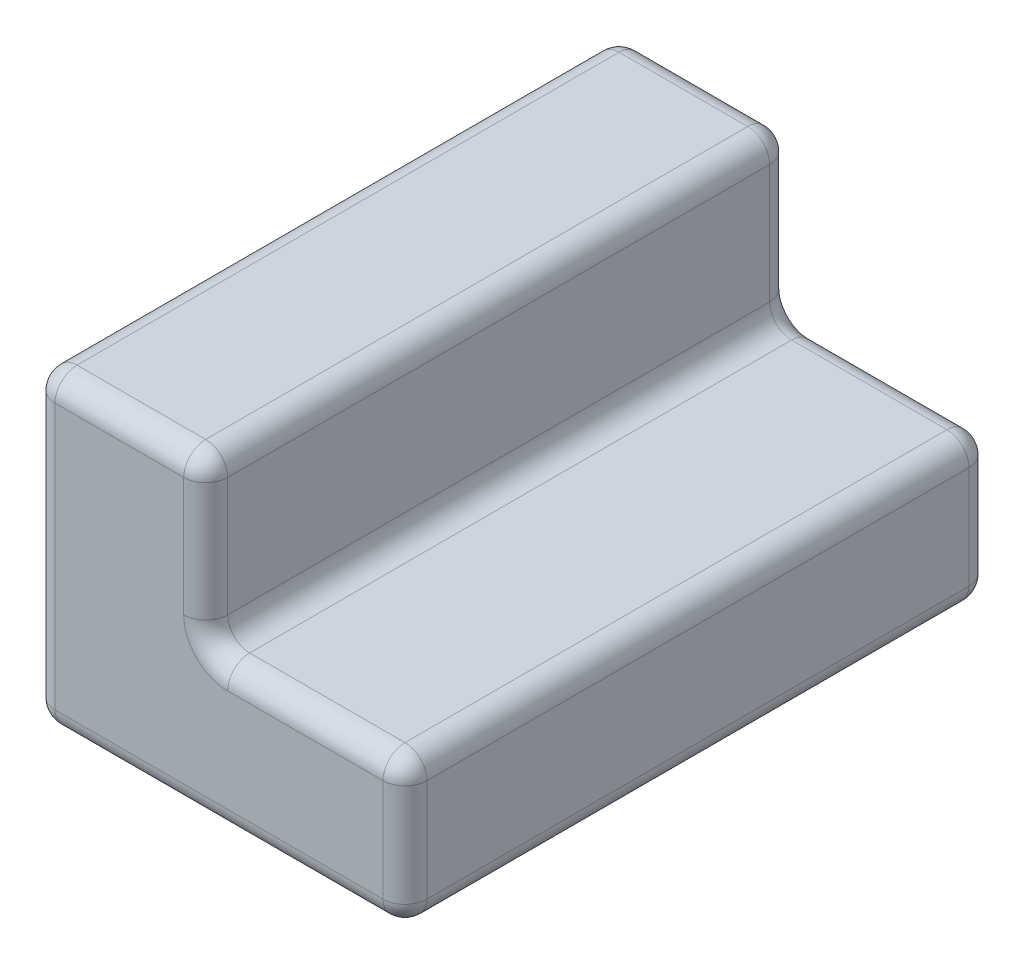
ISO-10303-21;
HEADER;
FILE_DESCRIPTION(('STEP AP214'),'2;1');
FILE_NAME('part.step','',(''),(''),'','','');
FILE_SCHEMA(('AUTOMOTIVE_DESIGN { 1 0 10303 214 1 1 1 1 }'));
ENDSEC;
DATA;
#1=APPLICATION_CONTEXT('core data for automotive mechanical design processes');
#2=APPLICATION_PROTOCOL_DEFINITION('international standard','automotive_design',2000,#1);
#3=PRODUCT_CONTEXT('',#1,'mechanical');
#4=PRODUCT('Part','Part','',(#3));
#5=PRODUCT_RELATED_PRODUCT_CATEGORY('part','',(#4));
#6=PRODUCT_DEFINITION_FORMATION('','',#4);
#7=PRODUCT_DEFINITION_CONTEXT('part definition',#1,'design');
#8=PRODUCT_DEFINITION('design','',#6,#7);
#9=PRODUCT_DEFINITION_SHAPE('','',#8);
#10=(LENGTH_UNIT() NAMED_UNIT(*) SI_UNIT(.MILLI.,.METRE.));
#11=(NAMED_UNIT(*) PLANE_ANGLE_UNIT() SI_UNIT($,.RADIAN.));
#12=(NAMED_UNIT(*) SI_UNIT($,.STERADIAN.) SOLID_ANGLE_UNIT());
#13=UNCERTAINTY_MEASURE_WITH_UNIT(LENGTH_MEASURE(1.E-05),#10,'distance_accuracy_value','');
#14=(GEOMETRIC_REPRESENTATION_CONTEXT(3) GLOBAL_UNCERTAINTY_ASSIGNED_CONTEXT((#13)) GLOBAL_UNIT_ASSIGNED_CONTEXT((#10,
#11,#12)) REPRESENTATION_CONTEXT('',''));
#15=CARTESIAN_POINT('',(0.,0.,0.));
#16=DIRECTION('',(0.,0.,1.));
#17=DIRECTION('',(1.,0.,0.));
#18=AXIS2_PLACEMENT_3D('',#15,#16,#17);
#19=CARTESIAN_POINT('',(0.,0.,203.2));
#20=DIRECTION('',(1.,0.,0.));
#21=DIRECTION('',(0.,0.,-1.));
#22=AXIS2_PLACEMENT_3D('',#19,#20,#21);
#23=PLANE('',#22);
#24=DIRECTION('',(0.,0.,-1.));
#25=VECTOR('',#24,1.);
#26=CARTESIAN_POINT('',(0.,99.7014248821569,203.2));
#27=LINE('',#26,#25);
#28=CARTESIAN_POINT('',(0.,99.7014248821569,195.58));
#29=VERTEX_POINT('',#28);
#30=CARTESIAN_POINT('',(0.,99.7014248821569,7.61999999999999));
#31=VERTEX_POINT('',#30);
#32=EDGE_CURVE('E261',#29,#31,#27,.T.);
#33=ORIENTED_EDGE('',*,*,#32,.T.);
#34=DIRECTION('',(0.,-1.,0.));
#35=VECTOR('',#34,1.);
#36=CARTESIAN_POINT('',(0.,0.,7.61999999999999));
#37=LINE('',#36,#35);
#38=CARTESIAN_POINT('',(0.,7.62,7.61999999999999));
#39=VERTEX_POINT('',#38);
#40=EDGE_CURVE('E265',#31,#39,#37,.T.);
#41=ORIENTED_EDGE('',*,*,#40,.T.);
#42=DIRECTION('',(0.,0.,-1.));
#43=VECTOR('',#42,1.);
#44=CARTESIAN_POINT('',(0.,7.62,203.2));
#45=LINE('',#44,#43);
#46=CARTESIAN_POINT('',(0.,7.62,195.58));
#47=VERTEX_POINT('',#46);
#48=EDGE_CURVE('E263',#39,#47,#45,.F.);
#49=ORIENTED_EDGE('',*,*,#48,.T.);
#50=DIRECTION('',(0.,-1.,0.));
#51=VECTOR('',#50,1.);
#52=CARTESIAN_POINT('',(0.,0.,195.58));
#53=LINE('',#52,#51);
#54=EDGE_CURVE('E259',#47,#29,#53,.F.);
#55=ORIENTED_EDGE('',*,*,#54,.T.);
#56=EDGE_LOOP('',(#33,#41,#49,#55));
#57=FACE_BOUND('',#56,.T.);
#58=ADVANCED_FACE('F33',(#57),#23,.F.);
#59=CARTESIAN_POINT('',(0.,0.,203.2));
#60=DIRECTION('',(0.,1.,0.));
#61=DIRECTION('',(0.,0.,1.));
#62=AXIS2_PLACEMENT_3D('',#59,#60,#61);
#63=PLANE('',#62);
#64=DIRECTION('',(0.,0.,-1.));
#65=VECTOR('',#64,1.);
#66=CARTESIAN_POINT('',(7.62,0.,203.2));
#67=LINE('',#66,#65);
#68=CARTESIAN_POINT('',(7.62,0.,195.58));
#69=VERTEX_POINT('',#68);
#70=CARTESIAN_POINT('',(7.62,0.,7.61999999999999));
#71=VERTEX_POINT('',#70);
#72=EDGE_CURVE('E42',#69,#71,#67,.T.);
#73=ORIENTED_EDGE('',*,*,#72,.T.);
#74=DIRECTION('',(1.,0.,0.));
#75=VECTOR('',#74,1.);
#76=CARTESIAN_POINT('',(128.978214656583,0.,7.61999999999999));
#77=LINE('',#76,#75);
#78=CARTESIAN_POINT('',(121.358214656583,0.,7.61999999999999));
#79=VERTEX_POINT('',#78);
#80=EDGE_CURVE('E11',#71,#79,#77,.T.);
#81=ORIENTED_EDGE('',*,*,#80,.T.);
#82=DIRECTION('',(0.,0.,-1.));
#83=VECTOR('',#82,1.);
#84=CARTESIAN_POINT('',(121.358214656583,0.,203.2));
#85=LINE('',#84,#83);
#86=CARTESIAN_POINT('',(121.358214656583,0.,195.58));
#87=VERTEX_POINT('',#86);
#88=EDGE_CURVE('E268',#79,#87,#85,.F.);
#89=ORIENTED_EDGE('',*,*,#88,.T.);
#90=DIRECTION('',(1.,0.,0.));
#91=VECTOR('',#90,1.);
#92=CARTESIAN_POINT('',(0.,0.,195.58));
#93=LINE('',#92,#91);
#94=EDGE_CURVE('E53',#87,#69,#93,.F.);
#95=ORIENTED_EDGE('',*,*,#94,.T.);
#96=EDGE_LOOP('',(#73,#81,#89,#95));
#97=FACE_BOUND('',#96,.T.);
#98=ADVANCED_FACE('F404',(#97),#63,.F.);
#99=CARTESIAN_POINT('',(128.978214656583,50.8212666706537,203.2));
#100=DIRECTION('',(-1.,0.,0.));
#101=DIRECTION('',(0.,0.,1.));
#102=AXIS2_PLACEMENT_3D('',#99,#100,#101);
#103=PLANE('',#102);
#104=DIRECTION('',(0.,0.,-1.));
#105=VECTOR('',#104,1.);
#106=CARTESIAN_POINT('',(128.978214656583,7.62,203.2));
#107=LINE('',#106,#105);
#108=CARTESIAN_POINT('',(128.978214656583,7.62,195.58));
#109=VERTEX_POINT('',#108);
#110=CARTESIAN_POINT('',(128.978214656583,7.62,7.61999999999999));
#111=VERTEX_POINT('',#110);
#112=EDGE_CURVE('E228',#109,#111,#107,.T.);
#113=ORIENTED_EDGE('',*,*,#112,.T.);
#114=DIRECTION('',(0.,1.,0.));
#115=VECTOR('',#114,1.);
#116=CARTESIAN_POINT('',(128.978214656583,50.8212666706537,7.61999999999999));
#117=LINE('',#116,#115);
#118=CARTESIAN_POINT('',(128.978214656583,43.2012666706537,7.61999999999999));
#119=VERTEX_POINT('',#118);
#120=EDGE_CURVE('E233',#111,#119,#117,.T.);
#121=ORIENTED_EDGE('',*,*,#120,.T.);
#122=DIRECTION('',(0.,0.,-1.));
#123=VECTOR('',#122,1.);
#124=CARTESIAN_POINT('',(128.978214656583,43.2012666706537,203.2));
#125=LINE('',#124,#123);
#126=CARTESIAN_POINT('',(128.978214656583,43.2012666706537,195.58));
#127=VERTEX_POINT('',#126);
#128=EDGE_CURVE('E230',#119,#127,#125,.F.);
#129=ORIENTED_EDGE('',*,*,#128,.T.);
#130=DIRECTION('',(0.,1.,0.));
#131=VECTOR('',#130,1.);
#132=CARTESIAN_POINT('',(128.978214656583,50.8212666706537,195.58));
#133=LINE('',#132,#131);
#134=EDGE_CURVE('E226',#127,#109,#133,.F.);
#135=ORIENTED_EDGE('',*,*,#134,.T.);
#136=EDGE_LOOP('',(#113,#121,#129,#135));
#137=FACE_BOUND('',#136,.T.);
#138=ADVANCED_FACE('F377',(#137),#103,.F.);
#139=CARTESIAN_POINT('',(59.868992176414,50.8212666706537,203.2));
#140=DIRECTION('',(0.,-1.,0.));
#141=DIRECTION('',(0.,0.,-1.));
#142=AXIS2_PLACEMENT_3D('',#139,#140,#141);
#143=PLANE('',#142);
#144=DIRECTION('',(-1.,0.,0.));
#145=VECTOR('',#144,1.);
#146=CARTESIAN_POINT('',(59.868992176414,50.8212666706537,195.58));
#147=LINE('',#146,#145);
#148=CARTESIAN_POINT('',(67.488992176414,50.8212666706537,195.58));
#149=VERTEX_POINT('',#148);
#150=CARTESIAN_POINT('',(121.358214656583,50.8212666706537,195.58));
#151=VERTEX_POINT('',#150);
#152=EDGE_CURVE('E221',#149,#151,#147,.F.);
#153=ORIENTED_EDGE('',*,*,#152,.T.);
#154=DIRECTION('',(0.,0.,-1.));
#155=VECTOR('',#154,1.);
#156=CARTESIAN_POINT('',(121.358214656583,50.8212666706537,203.2));
#157=LINE('',#156,#155);
#158=CARTESIAN_POINT('',(121.358214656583,50.8212666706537,7.61999999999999));
#159=VERTEX_POINT('',#158);
#160=EDGE_CURVE('E223',#151,#159,#157,.T.);
#161=ORIENTED_EDGE('',*,*,#160,.T.);
#162=DIRECTION('',(-1.,0.,0.));
#163=VECTOR('',#162,1.);
#164=CARTESIAN_POINT('',(59.868992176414,50.8212666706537,7.61999999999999));
#165=LINE('',#164,#163);
#166=CARTESIAN_POINT('',(67.488992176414,50.8212666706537,7.61999999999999));
#167=VERTEX_POINT('',#166);
#168=EDGE_CURVE('E217',#159,#167,#165,.T.);
#169=ORIENTED_EDGE('',*,*,#168,.T.);
#170=DIRECTION('',(0.,0.,-1.));
#171=VECTOR('',#170,1.);
#172=CARTESIAN_POINT('',(67.488992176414,50.8212666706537,203.2));
#173=LINE('',#172,#171);
#174=EDGE_CURVE('E219',#167,#149,#173,.F.);
#175=ORIENTED_EDGE('',*,*,#174,.T.);
#176=EDGE_LOOP('',(#153,#161,#169,#175));
#177=FACE_BOUND('',#176,.T.);
#178=ADVANCED_FACE('F411',(#177),#143,.F.);
#179=CARTESIAN_POINT('',(59.868992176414,50.8212666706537,203.2));
#180=DIRECTION('',(-1.,0.,0.));
#181=DIRECTION('',(0.,0.,1.));
#182=AXIS2_PLACEMENT_3D('',#179,#180,#181);
#183=PLANE('',#182);
#184=DIRECTION('',(0.,0.,-1.));
#185=VECTOR('',#184,1.);
#186=CARTESIAN_POINT('',(59.868992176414,58.4412666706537,0.));
#187=LINE('',#186,#185);
#188=CARTESIAN_POINT('',(59.868992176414,58.4412666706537,195.58));
#189=VERTEX_POINT('',#188);
#190=CARTESIAN_POINT('',(59.868992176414,58.4412666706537,7.61999999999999));
#191=VERTEX_POINT('',#190);
#192=EDGE_CURVE('E197',#189,#191,#187,.T.);
#193=ORIENTED_EDGE('',*,*,#192,.T.);
#194=DIRECTION('',(0.,1.,0.));
#195=VECTOR('',#194,1.);
#196=CARTESIAN_POINT('',(59.868992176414,107.321424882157,7.61999999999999));
#197=LINE('',#196,#195);
#198=CARTESIAN_POINT('',(59.868992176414,99.7014248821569,7.61999999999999));
#199=VERTEX_POINT('',#198);
#200=EDGE_CURVE('E169',#191,#199,#197,.T.);
#201=ORIENTED_EDGE('',*,*,#200,.T.);
#202=DIRECTION('',(0.,0.,-1.));
#203=VECTOR('',#202,1.);
#204=CARTESIAN_POINT('',(59.868992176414,99.7014248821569,203.2));
#205=LINE('',#204,#203);
#206=CARTESIAN_POINT('',(59.868992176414,99.7014248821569,195.58));
#207=VERTEX_POINT('',#206);
#208=EDGE_CURVE('E187',#199,#207,#205,.F.);
#209=ORIENTED_EDGE('',*,*,#208,.T.);
#210=DIRECTION('',(0.,1.,0.));
#211=VECTOR('',#210,1.);
#212=CARTESIAN_POINT('',(59.868992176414,50.8212666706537,195.58));
#213=LINE('',#212,#211);
#214=EDGE_CURVE('E193',#207,#189,#213,.F.);
#215=ORIENTED_EDGE('',*,*,#214,.T.);
#216=EDGE_LOOP('',(#193,#201,#209,#215));
#217=FACE_BOUND('',#216,.T.);
#218=ADVANCED_FACE('F195',(#217),#183,.F.);
#219=CARTESIAN_POINT('',(0.,107.321424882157,203.2));
#220=DIRECTION('',(0.,-1.,0.));
#221=DIRECTION('',(0.,0.,-1.));
#222=AXIS2_PLACEMENT_3D('',#219,#220,#221);
#223=PLANE('',#222);
#224=DIRECTION('',(0.,0.,-1.));
#225=VECTOR('',#224,1.);
#226=CARTESIAN_POINT('',(52.248992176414,107.321424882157,203.2));
#227=LINE('',#226,#225);
#228=CARTESIAN_POINT('',(52.248992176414,107.321424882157,195.58));
#229=VERTEX_POINT('',#228);
#230=CARTESIAN_POINT('',(52.248992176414,107.321424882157,7.61999999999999));
#231=VERTEX_POINT('',#230);
#232=EDGE_CURVE('E250',#229,#231,#227,.T.);
#233=ORIENTED_EDGE('',*,*,#232,.T.);
#234=DIRECTION('',(-1.,0.,0.));
#235=VECTOR('',#234,1.);
#236=CARTESIAN_POINT('',(0.,107.321424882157,7.61999999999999));
#237=LINE('',#236,#235);
#238=CARTESIAN_POINT('',(7.62,107.321424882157,7.61999999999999));
#239=VERTEX_POINT('',#238);
#240=EDGE_CURVE('E256',#231,#239,#237,.T.);
#241=ORIENTED_EDGE('',*,*,#240,.T.);
#242=DIRECTION('',(0.,0.,-1.));
#243=VECTOR('',#242,1.);
#244=CARTESIAN_POINT('',(7.62,107.321424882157,203.2));
#245=LINE('',#244,#243);
#246=CARTESIAN_POINT('',(7.62,107.321424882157,195.58));
#247=VERTEX_POINT('',#246);
#248=EDGE_CURVE('E254',#239,#247,#245,.F.);
#249=ORIENTED_EDGE('',*,*,#248,.T.);
#250=DIRECTION('',(-1.,0.,0.));
#251=VECTOR('',#250,1.);
#252=CARTESIAN_POINT('',(0.,107.321424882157,195.58));
#253=LINE('',#252,#251);
#254=EDGE_CURVE('E252',#247,#229,#253,.F.);
#255=ORIENTED_EDGE('',*,*,#254,.T.);
#256=EDGE_LOOP('',(#233,#241,#249,#255));
#257=FACE_BOUND('',#256,.T.);
#258=ADVANCED_FACE('F523',(#257),#223,.F.);
#259=CARTESIAN_POINT('',(0.,0.,203.2));
#260=DIRECTION('',(0.,0.,-1.));
#261=DIRECTION('',(-1.,0.,0.));
#262=AXIS2_PLACEMENT_3D('',#259,#260,#261);
#263=PLANE('',#262);
#264=DIRECTION('',(-1.,0.,0.));
#265=VECTOR('',#264,1.);
#266=CARTESIAN_POINT('',(0.,99.7014248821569,203.2));
#267=LINE('',#266,#265);
#268=CARTESIAN_POINT('',(52.248992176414,99.7014248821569,203.2));
#269=VERTEX_POINT('',#268);
#270=CARTESIAN_POINT('',(7.62,99.7014248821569,203.2));
#271=VERTEX_POINT('',#270);
#272=EDGE_CURVE('E237',#269,#271,#267,.T.);
#273=ORIENTED_EDGE('',*,*,#272,.T.);
#274=DIRECTION('',(0.,-1.,0.));
#275=VECTOR('',#274,1.);
#276=CARTESIAN_POINT('',(7.62,0.,203.2));
#277=LINE('',#276,#275);
#278=CARTESIAN_POINT('',(7.62,7.62,203.2));
#279=VERTEX_POINT('',#278);
#280=EDGE_CURVE('E248',#271,#279,#277,.T.);
#281=ORIENTED_EDGE('',*,*,#280,.T.);
#282=DIRECTION('',(1.,0.,0.));
#283=VECTOR('',#282,1.);
#284=CARTESIAN_POINT('',(0.,7.62,203.2));
#285=LINE('',#284,#283);
#286=CARTESIAN_POINT('',(121.358214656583,7.62,203.2));
#287=VERTEX_POINT('',#286);
#288=EDGE_CURVE('E246',#279,#287,#285,.T.);
#289=ORIENTED_EDGE('',*,*,#288,.T.);
#290=DIRECTION('',(0.,1.,0.));
#291=VECTOR('',#290,1.);
#292=CARTESIAN_POINT('',(121.358214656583,0.,203.2));
#293=LINE('',#292,#291);
#294=CARTESIAN_POINT('',(121.358214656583,43.2012666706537,203.2));
#295=VERTEX_POINT('',#294);
#296=EDGE_CURVE('E244',#287,#295,#293,.T.);
#297=ORIENTED_EDGE('',*,*,#296,.T.);
#298=DIRECTION('',(-1.,0.,0.));
#299=VECTOR('',#298,1.);
#300=CARTESIAN_POINT('',(0.,43.2012666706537,203.2));
#301=LINE('',#300,#299);
#302=CARTESIAN_POINT('',(67.488992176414,43.2012666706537,203.2));
#303=VERTEX_POINT('',#302);
#304=EDGE_CURVE('E241',#295,#303,#301,.T.);
#305=ORIENTED_EDGE('',*,*,#304,.T.);
#306=CARTESIAN_POINT('',(67.488992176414,58.4412666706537,203.2));
#307=DIRECTION('',(0.,0.,-1.));
#308=DIRECTION('',(-1.,0.,0.));
#309=AXIS2_PLACEMENT_3D('',#306,#307,#308);
#310=CIRCLE('',#309,15.24);
#311=CARTESIAN_POINT('',(52.248992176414,58.4412666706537,203.2));
#312=VERTEX_POINT('',#311);
#313=EDGE_CURVE('E239',#312,#303,#310,.F.);
#314=ORIENTED_EDGE('',*,*,#313,.F.);
#315=DIRECTION('',(0.,1.,0.));
#316=VECTOR('',#315,1.);
#317=CARTESIAN_POINT('',(52.248992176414,0.,203.2));
#318=LINE('',#317,#316);
#319=EDGE_CURVE('E235',#312,#269,#318,.T.);
#320=ORIENTED_EDGE('',*,*,#319,.T.);
#321=EDGE_LOOP('',(#273,#281,#289,#297,#305,#314,#320));
#322=FACE_BOUND('',#321,.T.);
#323=ADVANCED_FACE('F386',(#322),#263,.F.);
#324=CARTESIAN_POINT('',(0.,0.,0.));
#325=DIRECTION('',(0.,0.,-1.));
#326=DIRECTION('',(-1.,0.,0.));
#327=AXIS2_PLACEMENT_3D('',#324,#325,#326);
#328=PLANE('',#327);
#329=DIRECTION('',(-1.,0.,0.));
#330=VECTOR('',#329,1.);
#331=CARTESIAN_POINT('',(59.868992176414,99.7014248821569,0.));
#332=LINE('',#331,#330);
#333=CARTESIAN_POINT('',(7.62,99.7014248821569,0.));
#334=VERTEX_POINT('',#333);
#335=CARTESIAN_POINT('',(52.248992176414,99.7014248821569,0.));
#336=VERTEX_POINT('',#335);
#337=EDGE_CURVE('E209',#334,#336,#332,.F.);
#338=ORIENTED_EDGE('',*,*,#337,.T.);
#339=DIRECTION('',(0.,1.,0.));
#340=VECTOR('',#339,1.);
#341=CARTESIAN_POINT('',(52.248992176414,50.8212666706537,0.));
#342=LINE('',#341,#340);
#343=CARTESIAN_POINT('',(52.248992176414,58.4412666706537,0.));
#344=VERTEX_POINT('',#343);
#345=EDGE_CURVE('E171',#336,#344,#342,.F.);
#346=ORIENTED_EDGE('',*,*,#345,.T.);
#347=CARTESIAN_POINT('',(67.488992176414,58.4412666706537,0.));
#348=DIRECTION('',(0.,0.,-1.));
#349=DIRECTION('',(-1.,0.,0.));
#350=AXIS2_PLACEMENT_3D('',#347,#348,#349);
#351=CIRCLE('',#350,15.24);
#352=CARTESIAN_POINT('',(67.488992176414,43.2012666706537,0.));
#353=VERTEX_POINT('',#352);
#354=EDGE_CURVE('E213',#353,#344,#351,.T.);
#355=ORIENTED_EDGE('',*,*,#354,.F.);
#356=DIRECTION('',(-1.,0.,0.));
#357=VECTOR('',#356,1.);
#358=CARTESIAN_POINT('',(128.978214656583,43.2012666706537,0.));
#359=LINE('',#358,#357);
#360=CARTESIAN_POINT('',(121.358214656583,43.2012666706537,0.));
#361=VERTEX_POINT('',#360);
#362=EDGE_CURVE('E211',#353,#361,#359,.F.);
#363=ORIENTED_EDGE('',*,*,#362,.T.);
#364=DIRECTION('',(0.,1.,0.));
#365=VECTOR('',#364,1.);
#366=CARTESIAN_POINT('',(121.358214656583,0.,0.));
#367=LINE('',#366,#365);
#368=CARTESIAN_POINT('',(121.358214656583,7.62,0.));
#369=VERTEX_POINT('',#368);
#370=EDGE_CURVE('E199',#361,#369,#367,.F.);
#371=ORIENTED_EDGE('',*,*,#370,.T.);
#372=DIRECTION('',(1.,0.,0.));
#373=VECTOR('',#372,1.);
#374=CARTESIAN_POINT('',(0.,7.62,0.));
#375=LINE('',#374,#373);
#376=CARTESIAN_POINT('',(7.62,7.62,0.));
#377=VERTEX_POINT('',#376);
#378=EDGE_CURVE('E201',#369,#377,#375,.F.);
#379=ORIENTED_EDGE('',*,*,#378,.T.);
#380=DIRECTION('',(0.,-1.,0.));
#381=VECTOR('',#380,1.);
#382=CARTESIAN_POINT('',(7.62,107.321424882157,0.));
#383=LINE('',#382,#381);
#384=EDGE_CURVE('E207',#377,#334,#383,.F.);
#385=ORIENTED_EDGE('',*,*,#384,.T.);
#386=EDGE_LOOP('',(#338,#346,#355,#363,#371,#379,#385));
#387=FACE_BOUND('',#386,.T.);
#388=ADVANCED_FACE('F514',(#387),#328,.T.);
#389=CARTESIAN_POINT('',(0.,7.62,195.58));
#390=DIRECTION('',(1.,0.,0.));
#391=DIRECTION('',(0.,0.,-1.));
#392=AXIS2_PLACEMENT_3D('',#389,#390,#391);
#393=CYLINDRICAL_SURFACE('',#392,7.62);
#394=CARTESIAN_POINT('',(121.358214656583,7.62,195.58));
#395=DIRECTION('',(1.,0.,0.));
#396=DIRECTION('',(0.,0.,-1.));
#397=AXIS2_PLACEMENT_3D('',#394,#395,#396);
#398=CIRCLE('',#397,7.62);
#399=EDGE_CURVE('E37',#287,#87,#398,.T.);
#400=ORIENTED_EDGE('',*,*,#399,.F.);
#401=ORIENTED_EDGE('',*,*,#288,.F.);
#402=CARTESIAN_POINT('',(7.62,7.62,195.58));
#403=DIRECTION('',(-1.,0.,0.));
#404=DIRECTION('',(0.,0.,1.));
#405=AXIS2_PLACEMENT_3D('',#402,#403,#404);
#406=CIRCLE('',#405,7.62);
#407=EDGE_CURVE('E356',#69,#279,#406,.T.);
#408=ORIENTED_EDGE('',*,*,#407,.F.);
#409=ORIENTED_EDGE('',*,*,#94,.F.);
#410=EDGE_LOOP('',(#400,#401,#408,#409));
#411=FACE_BOUND('',#410,.T.);
#412=ADVANCED_FACE('F35',(#411),#393,.T.);
#413=CARTESIAN_POINT('',(121.358214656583,7.62,195.58));
#414=DIRECTION('',(0.,0.,1.));
#415=DIRECTION('',(1.,0.,0.));
#416=AXIS2_PLACEMENT_3D('',#413,#414,#415);
#417=SPHERICAL_SURFACE('',#416,7.62);
#418=CARTESIAN_POINT('',(121.358214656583,7.62,195.58));
#419=DIRECTION('',(0.,-1.,0.));
#420=DIRECTION('',(0.,0.,-1.));
#421=AXIS2_PLACEMENT_3D('',#418,#419,#420);
#422=CIRCLE('',#421,7.62);
#423=EDGE_CURVE('E351',#287,#109,#422,.F.);
#424=ORIENTED_EDGE('',*,*,#423,.F.);
#425=ORIENTED_EDGE('',*,*,#399,.T.);
#426=CARTESIAN_POINT('',(121.358214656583,7.62,195.58));
#427=DIRECTION('',(0.,0.,1.));
#428=DIRECTION('',(1.,0.,0.));
#429=AXIS2_PLACEMENT_3D('',#426,#427,#428);
#430=CIRCLE('',#429,7.62);
#431=EDGE_CURVE('E354',#109,#87,#430,.F.);
#432=ORIENTED_EDGE('',*,*,#431,.F.);
#433=EDGE_LOOP('',(#424,#425,#432));
#434=FACE_BOUND('',#433,.T.);
#435=ADVANCED_FACE('F366',(#434),#417,.T.);
#436=CARTESIAN_POINT('',(7.62,7.62,195.58));
#437=DIRECTION('',(0.,0.,1.));
#438=DIRECTION('',(1.,0.,0.));
#439=AXIS2_PLACEMENT_3D('',#436,#437,#438);
#440=SPHERICAL_SURFACE('',#439,7.62);
#441=CARTESIAN_POINT('',(7.62,7.62,195.58));
#442=DIRECTION('',(0.,0.,1.));
#443=DIRECTION('',(1.,0.,0.));
#444=AXIS2_PLACEMENT_3D('',#441,#442,#443);
#445=CIRCLE('',#444,7.62);
#446=EDGE_CURVE('E345',#69,#47,#445,.F.);
#447=ORIENTED_EDGE('',*,*,#446,.F.);
#448=ORIENTED_EDGE('',*,*,#407,.T.);
#449=CARTESIAN_POINT('',(7.62,7.62,195.58));
#450=DIRECTION('',(0.,-1.,0.));
#451=DIRECTION('',(0.,0.,-1.));
#452=AXIS2_PLACEMENT_3D('',#449,#450,#451);
#453=CIRCLE('',#452,7.62);
#454=EDGE_CURVE('E348',#47,#279,#453,.F.);
#455=ORIENTED_EDGE('',*,*,#454,.F.);
#456=EDGE_LOOP('',(#447,#448,#455));
#457=FACE_BOUND('',#456,.T.);
#458=ADVANCED_FACE('F389',(#457),#440,.T.);
#459=CARTESIAN_POINT('',(121.358214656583,7.62,203.2));
#460=DIRECTION('',(0.,0.,-1.));
#461=DIRECTION('',(-1.,0.,0.));
#462=AXIS2_PLACEMENT_3D('',#459,#460,#461);
#463=CYLINDRICAL_SURFACE('',#462,7.62);
#464=ORIENTED_EDGE('',*,*,#431,.T.);
#465=ORIENTED_EDGE('',*,*,#88,.F.);
#466=CARTESIAN_POINT('',(121.358214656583,7.62,7.61999999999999));
#467=DIRECTION('',(0.,0.,-1.));
#468=DIRECTION('',(-1.,0.,0.));
#469=AXIS2_PLACEMENT_3D('',#466,#467,#468);
#470=CIRCLE('',#469,7.62);
#471=EDGE_CURVE('E340',#111,#79,#470,.T.);
#472=ORIENTED_EDGE('',*,*,#471,.F.);
#473=ORIENTED_EDGE('',*,*,#112,.F.);
#474=EDGE_LOOP('',(#464,#465,#472,#473));
#475=FACE_BOUND('',#474,.T.);
#476=ADVANCED_FACE('F373',(#475),#463,.T.);
#477=CARTESIAN_POINT('',(121.358214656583,0.,195.58));
#478=DIRECTION('',(0.,1.,0.));
#479=DIRECTION('',(0.,0.,1.));
#480=AXIS2_PLACEMENT_3D('',#477,#478,#479);
#481=CYLINDRICAL_SURFACE('',#480,7.62);
#482=ORIENTED_EDGE('',*,*,#423,.T.);
#483=ORIENTED_EDGE('',*,*,#134,.F.);
#484=CARTESIAN_POINT('',(121.358214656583,43.2012666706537,195.58));
#485=DIRECTION('',(0.,1.,0.));
#486=DIRECTION('',(0.,0.,1.));
#487=AXIS2_PLACEMENT_3D('',#484,#485,#486);
#488=CIRCLE('',#487,7.62);
#489=EDGE_CURVE('E337',#295,#127,#488,.T.);
#490=ORIENTED_EDGE('',*,*,#489,.F.);
#491=ORIENTED_EDGE('',*,*,#296,.F.);
#492=EDGE_LOOP('',(#482,#483,#490,#491));
#493=FACE_BOUND('',#492,.T.);
#494=ADVANCED_FACE('F383',(#493),#481,.T.);
#495=CARTESIAN_POINT('',(7.62,0.,195.58));
#496=DIRECTION('',(0.,-1.,0.));
#497=DIRECTION('',(0.,0.,-1.));
#498=AXIS2_PLACEMENT_3D('',#495,#496,#497);
#499=CYLINDRICAL_SURFACE('',#498,7.62);
#500=ORIENTED_EDGE('',*,*,#454,.T.);
#501=ORIENTED_EDGE('',*,*,#280,.F.);
#502=CARTESIAN_POINT('',(7.62,99.7014248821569,195.58));
#503=DIRECTION('',(0.,1.,0.));
#504=DIRECTION('',(0.,0.,1.));
#505=AXIS2_PLACEMENT_3D('',#502,#503,#504);
#506=CIRCLE('',#505,7.62);
#507=EDGE_CURVE('E334',#29,#271,#506,.T.);
#508=ORIENTED_EDGE('',*,*,#507,.F.);
#509=ORIENTED_EDGE('',*,*,#54,.F.);
#510=EDGE_LOOP('',(#500,#501,#508,#509));
#511=FACE_BOUND('',#510,.T.);
#512=ADVANCED_FACE('F501',(#511),#499,.T.);
#513=CARTESIAN_POINT('',(7.62,7.62,203.2));
#514=DIRECTION('',(0.,0.,-1.));
#515=DIRECTION('',(-1.,0.,0.));
#516=AXIS2_PLACEMENT_3D('',#513,#514,#515);
#517=CYLINDRICAL_SURFACE('',#516,7.62);
#518=ORIENTED_EDGE('',*,*,#446,.T.);
#519=ORIENTED_EDGE('',*,*,#48,.F.);
#520=CARTESIAN_POINT('',(7.62,7.62,7.61999999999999));
#521=DIRECTION('',(0.,0.,-1.));
#522=DIRECTION('',(-1.,0.,0.));
#523=AXIS2_PLACEMENT_3D('',#520,#521,#522);
#524=CIRCLE('',#523,7.62);
#525=EDGE_CURVE('E331',#71,#39,#524,.T.);
#526=ORIENTED_EDGE('',*,*,#525,.F.);
#527=ORIENTED_EDGE('',*,*,#72,.F.);
#528=EDGE_LOOP('',(#518,#519,#526,#527));
#529=FACE_BOUND('',#528,.T.);
#530=ADVANCED_FACE('F394',(#529),#517,.T.);
#531=CARTESIAN_POINT('',(0.,7.62,7.61999999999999));
#532=DIRECTION('',(-1.,0.,0.));
#533=DIRECTION('',(0.,0.,1.));
#534=AXIS2_PLACEMENT_3D('',#531,#532,#533);
#535=CYLINDRICAL_SURFACE('',#534,7.62);
#536=CARTESIAN_POINT('',(121.358214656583,7.62,7.61999999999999));
#537=DIRECTION('',(1.,0.,0.));
#538=DIRECTION('',(0.,0.,-1.));
#539=AXIS2_PLACEMENT_3D('',#536,#537,#538);
#540=CIRCLE('',#539,7.62);
#541=EDGE_CURVE('E342',#79,#369,#540,.T.);
#542=ORIENTED_EDGE('',*,*,#541,.F.);
#543=ORIENTED_EDGE('',*,*,#80,.F.);
#544=CARTESIAN_POINT('',(7.62,7.62,7.62));
#545=DIRECTION('',(-1.,0.,0.));
#546=DIRECTION('',(0.,0.,1.));
#547=AXIS2_PLACEMENT_3D('',#544,#545,#546);
#548=CIRCLE('',#547,7.62);
#549=EDGE_CURVE('E328',#377,#71,#548,.T.);
#550=ORIENTED_EDGE('',*,*,#549,.F.);
#551=ORIENTED_EDGE('',*,*,#378,.F.);
#552=EDGE_LOOP('',(#542,#543,#550,#551));
#553=FACE_BOUND('',#552,.T.);
#554=ADVANCED_FACE('F403',(#553),#535,.T.);
#555=CARTESIAN_POINT('',(121.358214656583,7.62,7.62));
#556=DIRECTION('',(0.,0.,1.));
#557=DIRECTION('',(1.,0.,0.));
#558=AXIS2_PLACEMENT_3D('',#555,#556,#557);
#559=SPHERICAL_SURFACE('',#558,7.62);
#560=ORIENTED_EDGE('',*,*,#471,.T.);
#561=ORIENTED_EDGE('',*,*,#541,.T.);
#562=CARTESIAN_POINT('',(121.358214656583,7.62,7.62));
#563=DIRECTION('',(0.,-1.,0.));
#564=DIRECTION('',(1.,0.,0.));
#565=AXIS2_PLACEMENT_3D('',#562,#563,#564);
#566=CIRCLE('',#565,7.62);
#567=EDGE_CURVE('E325',#111,#369,#566,.F.);
#568=ORIENTED_EDGE('',*,*,#567,.F.);
#569=EDGE_LOOP('',(#560,#561,#568));
#570=FACE_BOUND('',#569,.T.);
#571=ADVANCED_FACE('F492',(#570),#559,.T.);
#572=CARTESIAN_POINT('',(121.358214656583,43.2012666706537,195.58));
#573=DIRECTION('',(0.,0.,1.));
#574=DIRECTION('',(1.,0.,0.));
#575=AXIS2_PLACEMENT_3D('',#572,#573,#574);
#576=SPHERICAL_SURFACE('',#575,7.62);
#577=CARTESIAN_POINT('',(121.358214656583,43.2012666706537,195.58));
#578=DIRECTION('',(1.,0.,0.));
#579=DIRECTION('',(0.,0.,-1.));
#580=AXIS2_PLACEMENT_3D('',#577,#578,#579);
#581=CIRCLE('',#580,7.62);
#582=EDGE_CURVE('E320',#295,#151,#581,.F.);
#583=ORIENTED_EDGE('',*,*,#582,.F.);
#584=ORIENTED_EDGE('',*,*,#489,.T.);
#585=CARTESIAN_POINT('',(121.358214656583,43.2012666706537,195.58));
#586=DIRECTION('',(0.,0.,1.));
#587=DIRECTION('',(1.,0.,0.));
#588=AXIS2_PLACEMENT_3D('',#585,#586,#587);
#589=CIRCLE('',#588,7.62);
#590=EDGE_CURVE('E323',#151,#127,#589,.F.);
#591=ORIENTED_EDGE('',*,*,#590,.F.);
#592=EDGE_LOOP('',(#583,#584,#591));
#593=FACE_BOUND('',#592,.T.);
#594=ADVANCED_FACE('F488',(#593),#576,.T.);
#595=CARTESIAN_POINT('',(7.62,99.7014248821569,195.58));
#596=DIRECTION('',(0.,0.,1.));
#597=DIRECTION('',(1.,0.,0.));
#598=AXIS2_PLACEMENT_3D('',#595,#596,#597);
#599=SPHERICAL_SURFACE('',#598,7.62);
#600=CARTESIAN_POINT('',(7.62,99.7014248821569,195.58));
#601=DIRECTION('',(0.,0.,1.));
#602=DIRECTION('',(1.,0.,0.));
#603=AXIS2_PLACEMENT_3D('',#600,#601,#602);
#604=CIRCLE('',#603,7.62);
#605=EDGE_CURVE('E314',#29,#247,#604,.F.);
#606=ORIENTED_EDGE('',*,*,#605,.F.);
#607=ORIENTED_EDGE('',*,*,#507,.T.);
#608=CARTESIAN_POINT('',(7.62,99.7014248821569,195.58));
#609=DIRECTION('',(-1.,0.,0.));
#610=DIRECTION('',(0.,0.,1.));
#611=AXIS2_PLACEMENT_3D('',#608,#609,#610);
#612=CIRCLE('',#611,7.62);
#613=EDGE_CURVE('E317',#247,#271,#612,.F.);
#614=ORIENTED_EDGE('',*,*,#613,.F.);
#615=EDGE_LOOP('',(#606,#607,#614));
#616=FACE_BOUND('',#615,.T.);
#617=ADVANCED_FACE('F485',(#616),#599,.T.);
#618=CARTESIAN_POINT('',(7.62,7.62,7.62));
#619=DIRECTION('',(0.,0.,1.));
#620=DIRECTION('',(1.,0.,0.));
#621=AXIS2_PLACEMENT_3D('',#618,#619,#620);
#622=SPHERICAL_SURFACE('',#621,7.62);
#623=ORIENTED_EDGE('',*,*,#549,.T.);
#624=ORIENTED_EDGE('',*,*,#525,.T.);
#625=CARTESIAN_POINT('',(7.62,7.62,7.61999999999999));
#626=DIRECTION('',(0.,-1.,0.));
#627=DIRECTION('',(0.,0.,-1.));
#628=AXIS2_PLACEMENT_3D('',#625,#626,#627);
#629=CIRCLE('',#628,7.62);
#630=EDGE_CURVE('E312',#377,#39,#629,.F.);
#631=ORIENTED_EDGE('',*,*,#630,.F.);
#632=EDGE_LOOP('',(#623,#624,#631));
#633=FACE_BOUND('',#632,.T.);
#634=ADVANCED_FACE('F398',(#633),#622,.T.);
#635=CARTESIAN_POINT('',(121.358214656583,50.8212666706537,7.61999999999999));
#636=DIRECTION('',(0.,-1.,0.));
#637=DIRECTION('',(0.,0.,-1.));
#638=AXIS2_PLACEMENT_3D('',#635,#636,#637);
#639=CYLINDRICAL_SURFACE('',#638,7.62);
#640=ORIENTED_EDGE('',*,*,#567,.T.);
#641=ORIENTED_EDGE('',*,*,#370,.F.);
#642=CARTESIAN_POINT('',(121.358214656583,43.2012666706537,7.61999999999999));
#643=DIRECTION('',(0.,1.,0.));
#644=DIRECTION('',(0.,0.,1.));
#645=AXIS2_PLACEMENT_3D('',#642,#643,#644);
#646=CIRCLE('',#645,7.62);
#647=EDGE_CURVE('E309',#119,#361,#646,.T.);
#648=ORIENTED_EDGE('',*,*,#647,.F.);
#649=ORIENTED_EDGE('',*,*,#120,.F.);
#650=EDGE_LOOP('',(#640,#641,#648,#649));
#651=FACE_BOUND('',#650,.T.);
#652=ADVANCED_FACE('F478',(#651),#639,.T.);
#653=CARTESIAN_POINT('',(121.358214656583,43.2012666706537,203.2));
#654=DIRECTION('',(0.,0.,-1.));
#655=DIRECTION('',(-1.,0.,0.));
#656=AXIS2_PLACEMENT_3D('',#653,#654,#655);
#657=CYLINDRICAL_SURFACE('',#656,7.62);
#658=ORIENTED_EDGE('',*,*,#590,.T.);
#659=ORIENTED_EDGE('',*,*,#128,.F.);
#660=CARTESIAN_POINT('',(121.358214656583,43.2012666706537,7.61999999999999));
#661=DIRECTION('',(0.,0.,-1.));
#662=DIRECTION('',(-1.,0.,0.));
#663=AXIS2_PLACEMENT_3D('',#660,#661,#662);
#664=CIRCLE('',#663,7.62);
#665=EDGE_CURVE('E306',#159,#119,#664,.T.);
#666=ORIENTED_EDGE('',*,*,#665,.F.);
#667=ORIENTED_EDGE('',*,*,#160,.F.);
#668=EDGE_LOOP('',(#658,#659,#666,#667));
#669=FACE_BOUND('',#668,.T.);
#670=ADVANCED_FACE('F474',(#669),#657,.T.);
#671=CARTESIAN_POINT('',(0.,43.2012666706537,195.58));
#672=DIRECTION('',(-1.,0.,0.));
#673=DIRECTION('',(0.,0.,1.));
#674=AXIS2_PLACEMENT_3D('',#671,#672,#673);
#675=CYLINDRICAL_SURFACE('',#674,7.62);
#676=ORIENTED_EDGE('',*,*,#582,.T.);
#677=ORIENTED_EDGE('',*,*,#152,.F.);
#678=CARTESIAN_POINT('',(67.488992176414,43.2012666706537,195.58));
#679=DIRECTION('',(-1.,0.,0.));
#680=DIRECTION('',(0.,0.,1.));
#681=AXIS2_PLACEMENT_3D('',#678,#679,#680);
#682=CIRCLE('',#681,7.62);
#683=EDGE_CURVE('E303',#303,#149,#682,.T.);
#684=ORIENTED_EDGE('',*,*,#683,.F.);
#685=ORIENTED_EDGE('',*,*,#304,.F.);
#686=EDGE_LOOP('',(#676,#677,#684,#685));
#687=FACE_BOUND('',#686,.T.);
#688=ADVANCED_FACE('F470',(#687),#675,.T.);
#689=CARTESIAN_POINT('',(52.248992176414,0.,195.58));
#690=DIRECTION('',(0.,1.,0.));
#691=DIRECTION('',(0.,0.,1.));
#692=AXIS2_PLACEMENT_3D('',#689,#690,#691);
#693=CYLINDRICAL_SURFACE('',#692,7.62);
#694=CARTESIAN_POINT('',(52.248992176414,99.7014248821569,195.58));
#695=DIRECTION('',(0.,1.,0.));
#696=DIRECTION('',(0.,0.,1.));
#697=AXIS2_PLACEMENT_3D('',#694,#695,#696);
#698=CIRCLE('',#697,7.62);
#699=EDGE_CURVE('E297',#269,#207,#698,.T.);
#700=ORIENTED_EDGE('',*,*,#699,.F.);
#701=ORIENTED_EDGE('',*,*,#319,.F.);
#702=CARTESIAN_POINT('',(52.248992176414,58.4412666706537,195.58));
#703=DIRECTION('',(0.,-1.,0.));
#704=DIRECTION('',(0.,0.,-1.));
#705=AXIS2_PLACEMENT_3D('',#702,#703,#704);
#706=CIRCLE('',#705,7.62);
#707=EDGE_CURVE('E300',#189,#312,#706,.T.);
#708=ORIENTED_EDGE('',*,*,#707,.F.);
#709=ORIENTED_EDGE('',*,*,#214,.F.);
#710=EDGE_LOOP('',(#700,#701,#708,#709));
#711=FACE_BOUND('',#710,.T.);
#712=ADVANCED_FACE('F466',(#711),#693,.T.);
#713=CARTESIAN_POINT('',(0.,99.7014248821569,195.58));
#714=DIRECTION('',(-1.,0.,0.));
#715=DIRECTION('',(0.,0.,1.));
#716=AXIS2_PLACEMENT_3D('',#713,#714,#715);
#717=CYLINDRICAL_SURFACE('',#716,7.62);
#718=ORIENTED_EDGE('',*,*,#613,.T.);
#719=ORIENTED_EDGE('',*,*,#272,.F.);
#720=CARTESIAN_POINT('',(52.248992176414,99.7014248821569,195.58));
#721=DIRECTION('',(1.,0.,0.));
#722=DIRECTION('',(0.,0.,-1.));
#723=AXIS2_PLACEMENT_3D('',#720,#721,#722);
#724=CIRCLE('',#723,7.62);
#725=EDGE_CURVE('E294',#229,#269,#724,.T.);
#726=ORIENTED_EDGE('',*,*,#725,.F.);
#727=ORIENTED_EDGE('',*,*,#254,.F.);
#728=EDGE_LOOP('',(#718,#719,#726,#727));
#729=FACE_BOUND('',#728,.T.);
#730=ADVANCED_FACE('F462',(#729),#717,.T.);
#731=CARTESIAN_POINT('',(7.62,99.7014248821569,203.2));
#732=DIRECTION('',(0.,0.,-1.));
#733=DIRECTION('',(-1.,0.,0.));
#734=AXIS2_PLACEMENT_3D('',#731,#732,#733);
#735=CYLINDRICAL_SURFACE('',#734,7.62);
#736=ORIENTED_EDGE('',*,*,#605,.T.);
#737=ORIENTED_EDGE('',*,*,#248,.F.);
#738=CARTESIAN_POINT('',(7.62,99.7014248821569,7.61999999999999));
#739=DIRECTION('',(0.,0.,-1.));
#740=DIRECTION('',(-1.,0.,0.));
#741=AXIS2_PLACEMENT_3D('',#738,#739,#740);
#742=CIRCLE('',#741,7.62);
#743=EDGE_CURVE('E291',#31,#239,#742,.T.);
#744=ORIENTED_EDGE('',*,*,#743,.F.);
#745=ORIENTED_EDGE('',*,*,#32,.F.);
#746=EDGE_LOOP('',(#736,#737,#744,#745));
#747=FACE_BOUND('',#746,.T.);
#748=ADVANCED_FACE('F458',(#747),#735,.T.);
#749=CARTESIAN_POINT('',(7.62,0.,7.61999999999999));
#750=DIRECTION('',(0.,1.,0.));
#751=DIRECTION('',(0.,0.,1.));
#752=AXIS2_PLACEMENT_3D('',#749,#750,#751);
#753=CYLINDRICAL_SURFACE('',#752,7.62);
#754=ORIENTED_EDGE('',*,*,#630,.T.);
#755=ORIENTED_EDGE('',*,*,#40,.F.);
#756=CARTESIAN_POINT('',(7.62,99.7014248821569,7.62));
#757=DIRECTION('',(0.,1.,0.));
#758=DIRECTION('',(0.,0.,1.));
#759=AXIS2_PLACEMENT_3D('',#756,#757,#758);
#760=CIRCLE('',#759,7.62);
#761=EDGE_CURVE('E288',#334,#31,#760,.T.);
#762=ORIENTED_EDGE('',*,*,#761,.F.);
#763=ORIENTED_EDGE('',*,*,#384,.F.);
#764=EDGE_LOOP('',(#754,#755,#762,#763));
#765=FACE_BOUND('',#764,.T.);
#766=ADVANCED_FACE('F454',(#765),#753,.T.);
#767=CARTESIAN_POINT('',(121.358214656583,43.2012666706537,7.62));
#768=DIRECTION('',(0.,0.,1.));
#769=DIRECTION('',(1.,0.,0.));
#770=AXIS2_PLACEMENT_3D('',#767,#768,#769);
#771=SPHERICAL_SURFACE('',#770,7.62);
#772=ORIENTED_EDGE('',*,*,#665,.T.);
#773=ORIENTED_EDGE('',*,*,#647,.T.);
#774=CARTESIAN_POINT('',(121.358214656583,43.2012666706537,7.62));
#775=DIRECTION('',(1.,0.,0.));
#776=DIRECTION('',(0.,0.,-1.));
#777=AXIS2_PLACEMENT_3D('',#774,#775,#776);
#778=CIRCLE('',#777,7.62);
#779=EDGE_CURVE('E285',#159,#361,#778,.F.);
#780=ORIENTED_EDGE('',*,*,#779,.F.);
#781=EDGE_LOOP('',(#772,#773,#780));
#782=FACE_BOUND('',#781,.T.);
#783=ADVANCED_FACE('F450',(#782),#771,.T.);
#784=CARTESIAN_POINT('',(67.488992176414,58.4412666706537,195.58));
#785=DIRECTION('',(0.,0.,-1.));
#786=DIRECTION('',(-1.,0.,0.));
#787=AXIS2_PLACEMENT_3D('',#784,#785,#786);
#788=TOROIDAL_SURFACE('',#787,15.24,7.62);
#789=ORIENTED_EDGE('',*,*,#313,.T.);
#790=ORIENTED_EDGE('',*,*,#683,.T.);
#791=CARTESIAN_POINT('',(67.488992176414,58.4412666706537,195.58));
#792=DIRECTION('',(0.,0.,-1.));
#793=DIRECTION('',(-1.,0.,0.));
#794=AXIS2_PLACEMENT_3D('',#791,#792,#793);
#795=CIRCLE('',#794,7.62);
#796=EDGE_CURVE('E282',#189,#149,#795,.F.);
#797=ORIENTED_EDGE('',*,*,#796,.F.);
#798=ORIENTED_EDGE('',*,*,#707,.T.);
#799=EDGE_LOOP('',(#789,#790,#797,#798));
#800=FACE_BOUND('',#799,.T.);
#801=ADVANCED_FACE('F446',(#800),#788,.T.);
#802=CARTESIAN_POINT('',(52.248992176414,99.7014248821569,195.58));
#803=DIRECTION('',(0.,0.,1.));
#804=DIRECTION('',(1.,0.,0.));
#805=AXIS2_PLACEMENT_3D('',#802,#803,#804);
#806=SPHERICAL_SURFACE('',#805,7.62);
#807=ORIENTED_EDGE('',*,*,#725,.T.);
#808=ORIENTED_EDGE('',*,*,#699,.T.);
#809=CARTESIAN_POINT('',(52.248992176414,99.7014248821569,195.58));
#810=DIRECTION('',(0.,0.,1.));
#811=DIRECTION('',(1.,0.,0.));
#812=AXIS2_PLACEMENT_3D('',#809,#810,#811);
#813=CIRCLE('',#812,7.62);
#814=EDGE_CURVE('E190',#229,#207,#813,.F.);
#815=ORIENTED_EDGE('',*,*,#814,.F.);
#816=EDGE_LOOP('',(#807,#808,#815));
#817=FACE_BOUND('',#816,.T.);
#818=ADVANCED_FACE('F442',(#817),#806,.T.);
#819=CARTESIAN_POINT('',(7.62,99.7014248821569,7.62));
#820=DIRECTION('',(0.,0.,1.));
#821=DIRECTION('',(1.,0.,0.));
#822=AXIS2_PLACEMENT_3D('',#819,#820,#821);
#823=SPHERICAL_SURFACE('',#822,7.62);
#824=ORIENTED_EDGE('',*,*,#761,.T.);
#825=ORIENTED_EDGE('',*,*,#743,.T.);
#826=CARTESIAN_POINT('',(7.62,99.7014248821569,7.61999999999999));
#827=DIRECTION('',(-1.,0.,0.));
#828=DIRECTION('',(0.,0.,1.));
#829=AXIS2_PLACEMENT_3D('',#826,#827,#828);
#830=CIRCLE('',#829,7.62);
#831=EDGE_CURVE('E279',#334,#239,#830,.F.);
#832=ORIENTED_EDGE('',*,*,#831,.F.);
#833=EDGE_LOOP('',(#824,#825,#832));
#834=FACE_BOUND('',#833,.T.);
#835=ADVANCED_FACE('F438',(#834),#823,.T.);
#836=CARTESIAN_POINT('',(59.868992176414,43.2012666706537,7.61999999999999));
#837=DIRECTION('',(1.,0.,0.));
#838=DIRECTION('',(0.,0.,-1.));
#839=AXIS2_PLACEMENT_3D('',#836,#837,#838);
#840=CYLINDRICAL_SURFACE('',#839,7.62);
#841=ORIENTED_EDGE('',*,*,#779,.T.);
#842=ORIENTED_EDGE('',*,*,#362,.F.);
#843=CARTESIAN_POINT('',(67.488992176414,43.2012666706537,7.61999999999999));
#844=DIRECTION('',(-1.,0.,0.));
#845=DIRECTION('',(0.,0.,1.));
#846=AXIS2_PLACEMENT_3D('',#843,#844,#845);
#847=CIRCLE('',#846,7.62);
#848=EDGE_CURVE('E276',#167,#353,#847,.T.);
#849=ORIENTED_EDGE('',*,*,#848,.F.);
#850=ORIENTED_EDGE('',*,*,#168,.F.);
#851=EDGE_LOOP('',(#841,#842,#849,#850));
#852=FACE_BOUND('',#851,.T.);
#853=ADVANCED_FACE('F434',(#852),#840,.T.);
#854=CARTESIAN_POINT('',(67.488992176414,58.4412666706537,203.2));
#855=DIRECTION('',(0.,0.,1.));
#856=DIRECTION('',(1.,0.,0.));
#857=AXIS2_PLACEMENT_3D('',#854,#855,#856);
#858=CYLINDRICAL_SURFACE('',#857,7.62);
#859=ORIENTED_EDGE('',*,*,#796,.T.);
#860=ORIENTED_EDGE('',*,*,#174,.F.);
#861=CARTESIAN_POINT('',(67.488992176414,58.4412666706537,7.61999999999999));
#862=DIRECTION('',(0.,0.,-1.));
#863=DIRECTION('',(-1.,0.,0.));
#864=AXIS2_PLACEMENT_3D('',#861,#862,#863);
#865=CIRCLE('',#864,7.62);
#866=EDGE_CURVE('E184',#191,#167,#865,.F.);
#867=ORIENTED_EDGE('',*,*,#866,.F.);
#868=ORIENTED_EDGE('',*,*,#192,.F.);
#869=EDGE_LOOP('',(#859,#860,#867,#868));
#870=FACE_BOUND('',#869,.T.);
#871=ADVANCED_FACE('F431',(#870),#858,.F.);
#872=CARTESIAN_POINT('',(52.248992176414,99.7014248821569,203.2));
#873=DIRECTION('',(0.,0.,-1.));
#874=DIRECTION('',(-1.,0.,0.));
#875=AXIS2_PLACEMENT_3D('',#872,#873,#874);
#876=CYLINDRICAL_SURFACE('',#875,7.62);
#877=ORIENTED_EDGE('',*,*,#814,.T.);
#878=ORIENTED_EDGE('',*,*,#208,.F.);
#879=CARTESIAN_POINT('',(52.248992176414,99.7014248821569,7.61999999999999));
#880=DIRECTION('',(0.,0.,-1.));
#881=DIRECTION('',(-1.,0.,0.));
#882=AXIS2_PLACEMENT_3D('',#879,#880,#881);
#883=CIRCLE('',#882,7.62);
#884=EDGE_CURVE('E177',#231,#199,#883,.T.);
#885=ORIENTED_EDGE('',*,*,#884,.F.);
#886=ORIENTED_EDGE('',*,*,#232,.F.);
#887=EDGE_LOOP('',(#877,#878,#885,#886));
#888=FACE_BOUND('',#887,.T.);
#889=ADVANCED_FACE('F188',(#888),#876,.T.);
#890=CARTESIAN_POINT('',(0.,99.7014248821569,7.61999999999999));
#891=DIRECTION('',(1.,0.,0.));
#892=DIRECTION('',(0.,0.,-1.));
#893=AXIS2_PLACEMENT_3D('',#890,#891,#892);
#894=CYLINDRICAL_SURFACE('',#893,7.62);
#895=ORIENTED_EDGE('',*,*,#831,.T.);
#896=ORIENTED_EDGE('',*,*,#240,.F.);
#897=CARTESIAN_POINT('',(52.248992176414,99.7014248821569,7.62));
#898=DIRECTION('',(1.,0.,0.));
#899=DIRECTION('',(0.,0.,-1.));
#900=AXIS2_PLACEMENT_3D('',#897,#898,#899);
#901=CIRCLE('',#900,7.62);
#902=EDGE_CURVE('E181',#336,#231,#901,.T.);
#903=ORIENTED_EDGE('',*,*,#902,.F.);
#904=ORIENTED_EDGE('',*,*,#337,.F.);
#905=EDGE_LOOP('',(#895,#896,#903,#904));
#906=FACE_BOUND('',#905,.T.);
#907=ADVANCED_FACE('F424',(#906),#894,.T.);
#908=CARTESIAN_POINT('',(67.488992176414,58.4412666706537,7.61999999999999));
#909=DIRECTION('',(0.,0.,-1.));
#910=DIRECTION('',(-1.,0.,0.));
#911=AXIS2_PLACEMENT_3D('',#908,#909,#910);
#912=TOROIDAL_SURFACE('',#911,15.24,7.62);
#913=ORIENTED_EDGE('',*,*,#848,.T.);
#914=ORIENTED_EDGE('',*,*,#354,.T.);
#915=CARTESIAN_POINT('',(52.248992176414,58.4412666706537,7.62));
#916=DIRECTION('',(0.,-1.,0.));
#917=DIRECTION('',(0.,0.,-1.));
#918=AXIS2_PLACEMENT_3D('',#915,#916,#917);
#919=CIRCLE('',#918,7.62);
#920=EDGE_CURVE('E174',#191,#344,#919,.F.);
#921=ORIENTED_EDGE('',*,*,#920,.F.);
#922=ORIENTED_EDGE('',*,*,#866,.T.);
#923=EDGE_LOOP('',(#913,#914,#921,#922));
#924=FACE_BOUND('',#923,.T.);
#925=ADVANCED_FACE('F421',(#924),#912,.T.);
#926=CARTESIAN_POINT('',(52.248992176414,99.7014248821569,7.62));
#927=DIRECTION('',(0.,0.,1.));
#928=DIRECTION('',(1.,0.,0.));
#929=AXIS2_PLACEMENT_3D('',#926,#927,#928);
#930=SPHERICAL_SURFACE('',#929,7.62);
#931=ORIENTED_EDGE('',*,*,#902,.T.);
#932=ORIENTED_EDGE('',*,*,#884,.T.);
#933=CARTESIAN_POINT('',(52.248992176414,99.7014248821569,7.61999999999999));
#934=DIRECTION('',(0.,1.,0.));
#935=DIRECTION('',(0.,0.,1.));
#936=AXIS2_PLACEMENT_3D('',#933,#934,#935);
#937=CIRCLE('',#936,7.62);
#938=EDGE_CURVE('E165',#336,#199,#937,.F.);
#939=ORIENTED_EDGE('',*,*,#938,.F.);
#940=EDGE_LOOP('',(#931,#932,#939));
#941=FACE_BOUND('',#940,.T.);
#942=ADVANCED_FACE('F179',(#941),#930,.T.);
#943=CARTESIAN_POINT('',(52.248992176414,50.8212666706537,7.61999999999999));
#944=DIRECTION('',(0.,-1.,0.));
#945=DIRECTION('',(0.,0.,-1.));
#946=AXIS2_PLACEMENT_3D('',#943,#944,#945);
#947=CYLINDRICAL_SURFACE('',#946,7.62);
#948=ORIENTED_EDGE('',*,*,#920,.T.);
#949=ORIENTED_EDGE('',*,*,#345,.F.);
#950=ORIENTED_EDGE('',*,*,#938,.T.);
#951=ORIENTED_EDGE('',*,*,#200,.F.);
#952=EDGE_LOOP('',(#948,#949,#950,#951));
#953=FACE_BOUND('',#952,.T.);
#954=ADVANCED_FACE('F167',(#953),#947,.T.);
#955=CLOSED_SHELL('',(#58,#98,#138,#178,#218,#258,#323,#388,#412,#435,#458,#476,#494,#512,#530,
#554,#571,#594,#617,#634,#652,#670,#688,#712,#730,#748,#766,#783,#801,#818,#835,#853,#871,#889,
#907,#925,#942,#954));
#956=MANIFOLD_SOLID_BREP('B2',#955);
#957=ADVANCED_BREP_SHAPE_REPRESENTATION('',(#18,#956),#14);
#958=SHAPE_DEFINITION_REPRESENTATION(#9,#957);
ENDSEC;
END-ISO-10303-21;
